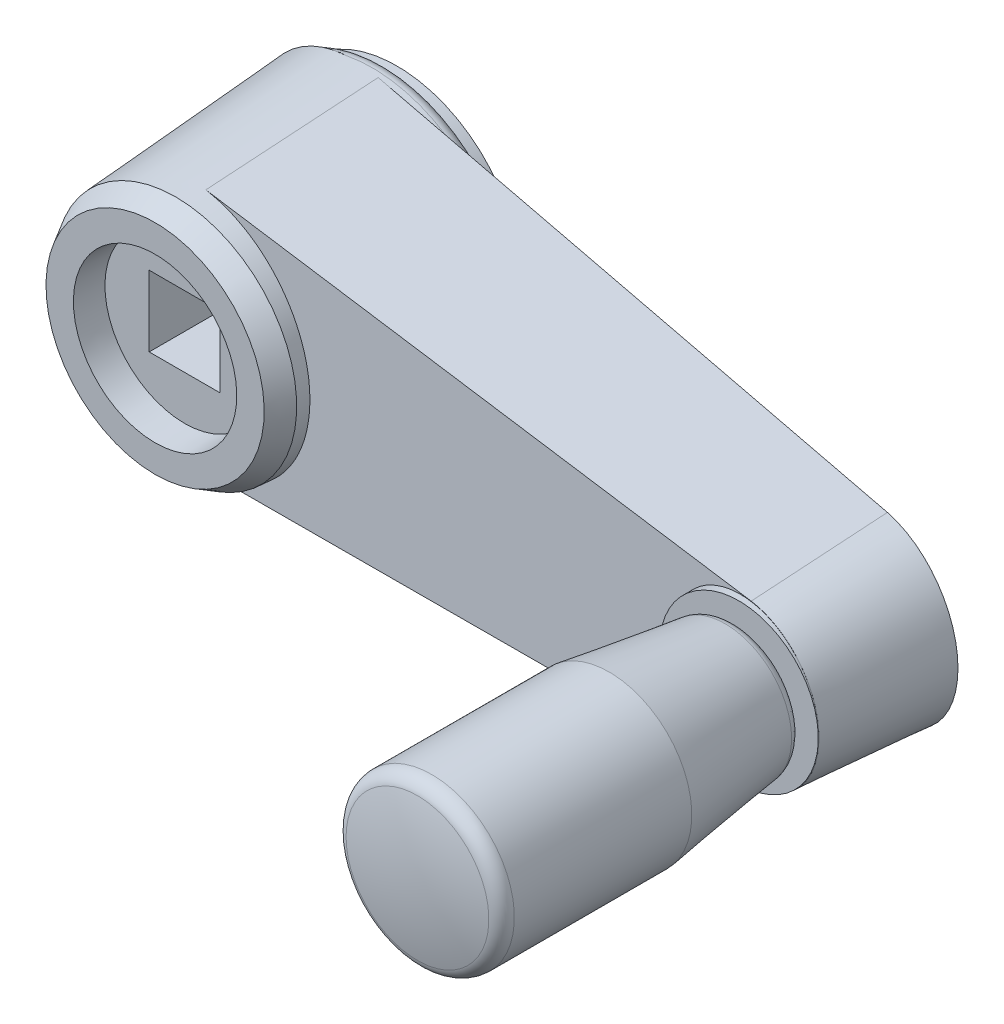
ISO-10303-21;
HEADER;
FILE_DESCRIPTION(('STEP AP214'),'2;1');
FILE_NAME('part.step','',(''),(''),'','','');
FILE_SCHEMA(('AUTOMOTIVE_DESIGN { 1 0 10303 214 1 1 1 1 }'));
ENDSEC;
DATA;
#1=APPLICATION_CONTEXT('core data for automotive mechanical design processes');
#2=APPLICATION_PROTOCOL_DEFINITION('international standard','automotive_design',2000,#1);
#3=PRODUCT_CONTEXT('',#1,'mechanical');
#4=PRODUCT('Part','Part','',(#3));
#5=PRODUCT_RELATED_PRODUCT_CATEGORY('part','',(#4));
#6=PRODUCT_DEFINITION_FORMATION('','',#4);
#7=PRODUCT_DEFINITION_CONTEXT('part definition',#1,'design');
#8=PRODUCT_DEFINITION('design','',#6,#7);
#9=PRODUCT_DEFINITION_SHAPE('','',#8);
#10=(LENGTH_UNIT() NAMED_UNIT(*) SI_UNIT(.MILLI.,.METRE.));
#11=(NAMED_UNIT(*) PLANE_ANGLE_UNIT() SI_UNIT($,.RADIAN.));
#12=(NAMED_UNIT(*) SI_UNIT($,.STERADIAN.) SOLID_ANGLE_UNIT());
#13=UNCERTAINTY_MEASURE_WITH_UNIT(LENGTH_MEASURE(1.E-05),#10,'distance_accuracy_value','');
#14=(GEOMETRIC_REPRESENTATION_CONTEXT(3) GLOBAL_UNCERTAINTY_ASSIGNED_CONTEXT((#13)) GLOBAL_UNIT_ASSIGNED_CONTEXT((#10,
#11,#12)) REPRESENTATION_CONTEXT('',''));
#15=CARTESIAN_POINT('',(0.,0.,0.));
#16=DIRECTION('',(0.,0.,1.));
#17=DIRECTION('',(1.,0.,0.));
#18=AXIS2_PLACEMENT_3D('',#15,#16,#17);
#19=CARTESIAN_POINT('',(-9.25,0.,20.5));
#20=DIRECTION('',(0.,0.,-1.));
#21=DIRECTION('',(0.,1.,0.));
#22=AXIS2_PLACEMENT_3D('',#19,#20,#21);
#23=PLANE('',#22);
#24=CARTESIAN_POINT('',(0.,0.,20.5));
#25=DIRECTION('',(0.,0.,1.));
#26=DIRECTION('',(0.,-1.,0.));
#27=AXIS2_PLACEMENT_3D('',#24,#25,#26);
#28=CIRCLE('',#27,9.25);
#29=CARTESIAN_POINT('',(0.,-9.25,20.5));
#30=VERTEX_POINT('',#29);
#31=EDGE_CURVE('E153',#30,#30,#28,.T.);
#32=ORIENTED_EDGE('',*,*,#31,.T.);
#33=EDGE_LOOP('',(#32));
#34=FACE_BOUND('',#33,.T.);
#35=CARTESIAN_POINT('',(0.,0.,20.5));
#36=DIRECTION('',(0.,0.,1.));
#37=DIRECTION('',(0.,-1.,0.));
#38=AXIS2_PLACEMENT_3D('',#35,#36,#37);
#39=CIRCLE('',#38,6.9248170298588);
#40=CARTESIAN_POINT('',(0.,-6.9248170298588,20.5));
#41=VERTEX_POINT('',#40);
#42=EDGE_CURVE('E139',#41,#41,#39,.T.);
#43=ORIENTED_EDGE('',*,*,#42,.F.);
#44=EDGE_LOOP('',(#43));
#45=FACE_BOUND('',#44,.T.);
#46=ADVANCED_FACE('F14',(#34,#45),#23,.F.);
#47=CARTESIAN_POINT('',(-11.5,-11.5,0.868643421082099));
#48=DIRECTION('',(-0.130237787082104,0.,0.99148278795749));
#49=DIRECTION('',(-0.99148278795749,0.,-0.130237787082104));
#50=AXIS2_PLACEMENT_3D('',#47,#48,#49);
#51=PLANE('',#50);
#52=CARTESIAN_POINT('',(-0.104670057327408,0.,2.36549497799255));
#53=DIRECTION('',(-0.130237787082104,0.,0.99148278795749));
#54=DIRECTION('',(-0.99148278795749,0.,-0.130237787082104));
#55=AXIS2_PLACEMENT_3D('',#52,#53,#54);
#56=ELLIPSE('',#55,11.4932201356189,11.394849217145);
#57=CARTESIAN_POINT('',(0.911596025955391,11.3494439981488,2.4989882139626));
#58=VERTEX_POINT('',#57);
#59=CARTESIAN_POINT('',(0.911596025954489,-11.3494439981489,2.4989882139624));
#60=VERTEX_POINT('',#59);
#61=EDGE_CURVE('E159',#58,#60,#56,.F.);
#62=ORIENTED_EDGE('',*,*,#61,.F.);
#63=DIRECTION('',(-0.988624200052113,0.0758813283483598,-0.129862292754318));
#64=VECTOR('',#63,1.);
#65=CARTESIAN_POINT('',(-9.71441205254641,12.1650376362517,1.10319214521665));
#66=LINE('',#65,#64);
#67=CARTESIAN_POINT('',(50.608289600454,7.53500052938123,9.02697586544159));
#68=VERTEX_POINT('',#67);
#69=EDGE_CURVE('E498',#68,#58,#66,.T.);
#70=ORIENTED_EDGE('',*,*,#69,.F.);
#71=CARTESIAN_POINT('',(49.930506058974,0.,8.9379445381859));
#72=DIRECTION('',(-0.130237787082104,0.,0.99148278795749));
#73=DIRECTION('',(-0.99148278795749,0.,-0.130237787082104));
#74=AXIS2_PLACEMENT_3D('',#71,#72,#73);
#75=ELLIPSE('',#74,7.63073206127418,7.56542032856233);
#76=CARTESIAN_POINT('',(50.608289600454,-7.53500052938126,9.02697586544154));
#77=VERTEX_POINT('',#76);
#78=EDGE_CURVE('E526',#68,#77,#75,.F.);
#79=ORIENTED_EDGE('',*,*,#78,.T.);
#80=DIRECTION('',(0.988624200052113,0.0758813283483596,0.129862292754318));
#81=VECTOR('',#80,1.);
#82=CARTESIAN_POINT('',(-11.4398287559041,-12.2974710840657,0.876547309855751));
#83=LINE('',#82,#81);
#84=EDGE_CURVE('E524',#77,#60,#83,.F.);
#85=ORIENTED_EDGE('',*,*,#84,.T.);
#86=EDGE_LOOP('',(#62,#70,#79,#85));
#87=FACE_BOUND('',#86,.T.);
#88=ADVANCED_FACE('F237',(#87),#51,.F.);
#89=CARTESIAN_POINT('',(56.7298365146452,-11.5,20.946098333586));
#90=DIRECTION('',(0.0697564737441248,0.,-0.997564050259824));
#91=DIRECTION('',(0.997564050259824,0.,0.0697564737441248));
#92=AXIS2_PLACEMENT_3D('',#89,#90,#91);
#93=PLANE('',#92);
#94=CARTESIAN_POINT('',(-0.0507248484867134,0.,16.9756146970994));
#95=DIRECTION('',(0.0697564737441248,0.,-0.997564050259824));
#96=DIRECTION('',(-0.997564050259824,0.,-0.0697564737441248));
#97=AXIS2_PLACEMENT_3D('',#94,#95,#96);
#98=ELLIPSE('',#97,10.3990223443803,10.3735668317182);
#99=CARTESIAN_POINT('',(0.836486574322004,-10.3355582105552,17.0376545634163));
#100=VERTEX_POINT('',#99);
#101=CARTESIAN_POINT('',(0.836486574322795,10.3355582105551,17.0376545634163));
#102=VERTEX_POINT('',#101);
#103=EDGE_CURVE('E500',#100,#102,#98,.F.);
#104=ORIENTED_EDGE('',*,*,#103,.F.);
#105=DIRECTION('',(-0.994968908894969,-0.072084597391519,-0.0695750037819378));
#106=VECTOR('',#105,1.);
#107=CARTESIAN_POINT('',(56.355888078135,-6.31322779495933,20.9199493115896));
#108=LINE('',#107,#106);
#109=CARTESIAN_POINT('',(50.5487553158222,-6.7339493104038,20.5138750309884));
#110=VERTEX_POINT('',#109);
#111=EDGE_CURVE('E531',#100,#110,#108,.F.);
#112=ORIENTED_EDGE('',*,*,#111,.T.);
#113=CARTESIAN_POINT('',(49.9669495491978,0.,20.473191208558));
#114=DIRECTION('',(0.0697564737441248,0.,-0.997564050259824));
#115=DIRECTION('',(-0.997564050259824,0.,-0.0697564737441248));
#116=AXIS2_PLACEMENT_3D('',#113,#114,#115);
#117=ELLIPSE('',#116,6.77562154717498,6.7590356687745);
#118=CARTESIAN_POINT('',(56.7191173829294,-0.306403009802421,20.9453487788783));
#119=VERTEX_POINT('',#118);
#120=EDGE_CURVE('E532',#110,#119,#117,.F.);
#121=ORIENTED_EDGE('',*,*,#120,.T.);
#122=CARTESIAN_POINT('',(50.,0.,20.4755023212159));
#123=DIRECTION('',(0.0697564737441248,0.,-0.997564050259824));
#124=DIRECTION('',(0.997564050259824,0.,0.0697564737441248));
#125=AXIS2_PLACEMENT_3D('',#122,#123,#124);
#126=ELLIPSE('',#125,6.74252445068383,6.7261);
#127=CARTESIAN_POINT('',(56.719117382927,0.306403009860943,20.9453487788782));
#128=VERTEX_POINT('',#127);
#129=EDGE_CURVE('E504',#119,#128,#126,.T.);
#130=ORIENTED_EDGE('',*,*,#129,.T.);
#131=CARTESIAN_POINT('',(50.5487553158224,6.73394931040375,20.5138750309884));
#132=VERTEX_POINT('',#131);
#133=EDGE_CURVE('E534',#128,#132,#117,.F.);
#134=ORIENTED_EDGE('',*,*,#133,.T.);
#135=DIRECTION('',(0.994968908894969,-0.0720845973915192,0.0695750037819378));
#136=VECTOR('',#135,1.);
#137=CARTESIAN_POINT('',(58.0054925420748,6.19371544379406,21.0353008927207));
#138=LINE('',#137,#136);
#139=EDGE_CURVE('E198',#102,#132,#138,.T.);
#140=ORIENTED_EDGE('',*,*,#139,.F.);
#141=EDGE_LOOP('',(#104,#112,#121,#130,#134,#140));
#142=FACE_BOUND('',#141,.T.);
#143=ADVANCED_FACE('F234',(#142),#93,.F.);
#144=CARTESIAN_POINT('',(0.,0.,0.868643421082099));
#145=DIRECTION('',(0.,0.,-1.));
#146=DIRECTION('',(0.,-1.,0.));
#147=AXIS2_PLACEMENT_3D('',#144,#145,#146);
#148=CONICAL_SURFACE('',#147,11.5,0.0698131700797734);
#149=CARTESIAN_POINT('',(-0.104670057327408,0.,2.36549497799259));
#150=DIRECTION('',(-0.130237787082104,0.,0.99148278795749));
#151=DIRECTION('',(-0.99148278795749,0.,-0.130237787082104));
#152=AXIS2_PLACEMENT_3D('',#149,#150,#151);
#153=ELLIPSE('',#152,11.4932201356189,11.3948492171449);
#154=CARTESIAN_POINT('',(-2.2077738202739,-11.1991033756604,2.0892384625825));
#155=VERTEX_POINT('',#154);
#156=CARTESIAN_POINT('',(-2.2077738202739,11.1991033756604,2.0892384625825));
#157=VERTEX_POINT('',#156);
#158=EDGE_CURVE('E509',#155,#157,#153,.F.);
#159=ORIENTED_EDGE('',*,*,#158,.F.);
#160=CARTESIAN_POINT('',(0.,0.,2.0892384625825));
#161=DIRECTION('',(0.,0.,1.));
#162=DIRECTION('',(0.,-1.,0.));
#163=AXIS2_PLACEMENT_3D('',#160,#161,#162);
#164=CIRCLE('',#163,11.4146476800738);
#165=EDGE_CURVE('E147',#155,#157,#164,.T.);
#166=ORIENTED_EDGE('',*,*,#165,.T.);
#167=EDGE_LOOP('',(#159,#166));
#168=FACE_BOUND('',#167,.T.);
#169=CARTESIAN_POINT('',(0.816240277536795,10.0629979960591,20.946098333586));
#170=CARTESIAN_POINT('',(0.833583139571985,10.2963518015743,17.59985587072));
#171=CARTESIAN_POINT('',(0.850901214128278,10.5297072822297,14.2536133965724));
#172=CARTESIAN_POINT('',(0.885487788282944,10.9964215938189,7.56112842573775));
#173=CARTESIAN_POINT('',(0.902756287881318,11.2297804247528,4.21488592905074));
#174=CARTESIAN_POINT('',(0.920000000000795,11.4631409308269,0.868643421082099));
#175=B_SPLINE_CURVE_WITH_KNOTS('',3,(#169,#170,#171,#172,#173,#174),.UNSPECIFIED.,.F.,.F.,(4,2,
4),(0.,10.0632420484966,20.1264840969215),.UNSPECIFIED.);
#176=EDGE_CURVE('E188',#102,#58,#175,.T.);
#177=ORIENTED_EDGE('',*,*,#176,.T.);
#178=ORIENTED_EDGE('',*,*,#61,.T.);
#179=CARTESIAN_POINT('',(0.816240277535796,-10.0629979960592,20.946098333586));
#180=CARTESIAN_POINT('',(0.833583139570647,-10.2963518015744,17.59985587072));
#181=CARTESIAN_POINT('',(0.850901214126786,-10.5297072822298,14.2536133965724));
#182=CARTESIAN_POINT('',(0.885487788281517,-10.9964215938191,7.56112842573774));
#183=CARTESIAN_POINT('',(0.902756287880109,-11.229780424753,4.21488592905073));
#184=CARTESIAN_POINT('',(0.91999999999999,-11.463140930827,0.868643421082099));
#185=B_SPLINE_CURVE_WITH_KNOTS('',3,(#179,#180,#181,#182,#183,#184),.UNSPECIFIED.,.F.,.F.,(4,2,
4),(0.,10.0632420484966,20.1264840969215),.UNSPECIFIED.);
#186=EDGE_CURVE('E189',#100,#60,#185,.T.);
#187=ORIENTED_EDGE('',*,*,#186,.F.);
#188=ORIENTED_EDGE('',*,*,#103,.T.);
#189=EDGE_LOOP('',(#177,#178,#187,#188));
#190=FACE_BOUND('',#189,.T.);
#191=CARTESIAN_POINT('',(0.,0.,18.744476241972));
#192=DIRECTION('',(0.,0.,1.));
#193=DIRECTION('',(0.,-1.,0.));
#194=AXIS2_PLACEMENT_3D('',#191,#192,#193);
#195=CIRCLE('',#194,10.25);
#196=CARTESIAN_POINT('',(0.,-10.25,18.744476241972));
#197=VERTEX_POINT('',#196);
#198=EDGE_CURVE('E150',#197,#197,#195,.T.);
#199=ORIENTED_EDGE('',*,*,#198,.F.);
#200=EDGE_LOOP('',(#199));
#201=FACE_BOUND('',#200,.T.);
#202=ADVANCED_FACE('F206',(#168,#190,#201),#148,.T.);
#203=CARTESIAN_POINT('',(0.91999999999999,-11.4631409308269,0.868643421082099));
#204=DIRECTION('',(0.0672304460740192,-0.995295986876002,0.0697564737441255));
#205=DIRECTION('',(0.,-0.0699146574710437,-0.997552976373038));
#206=AXIS2_PLACEMENT_3D('',#203,#204,#205);
#207=PLANE('',#206);
#208=ORIENTED_EDGE('',*,*,#111,.F.);
#209=ORIENTED_EDGE('',*,*,#186,.T.);
#210=ORIENTED_EDGE('',*,*,#84,.F.);
#211=CARTESIAN_POINT('',(50.5465090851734,-6.70380816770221,20.946098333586));
#212=CARTESIAN_POINT('',(50.5682362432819,-6.99540068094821,16.7646715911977));
#213=CARTESIAN_POINT('',(50.5899069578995,-7.28699700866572,12.5832448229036));
#214=CARTESIAN_POINT('',(50.6245011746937,-7.75371080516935,5.89075983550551));
#215=CARTESIAN_POINT('',(50.6374607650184,-7.9288258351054,3.37970163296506));
#216=CARTESIAN_POINT('',(50.6504,-8.10394224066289,0.868643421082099));
#217=B_SPLINE_CURVE_WITH_KNOTS('',3,(#211,#212,#213,#214,#215,#216),.UNSPECIFIED.,.F.,.F.,(4,2,
4),(0.,12.5749135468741,20.1264841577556),.UNSPECIFIED.);
#218=EDGE_CURVE('E199',#110,#77,#217,.T.);
#219=ORIENTED_EDGE('',*,*,#218,.F.);
#220=EDGE_LOOP('',(#208,#209,#210,#219));
#221=FACE_BOUND('',#220,.T.);
#222=ADVANCED_FACE('F209',(#221),#207,.T.);
#223=CARTESIAN_POINT('',(50.,0.,0.868643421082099));
#224=DIRECTION('',(0.,0.,-1.));
#225=DIRECTION('',(0.,-1.,0.));
#226=AXIS2_PLACEMENT_3D('',#223,#224,#225);
#227=CONICAL_SURFACE('',#226,8.13,0.0698131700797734);
#228=ORIENTED_EDGE('',*,*,#133,.F.);
#229=CARTESIAN_POINT('',(50.,0.,20.9453487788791));
#230=DIRECTION('',(0.,0.,-1.));
#231=DIRECTION('',(0.,1.,0.));
#232=AXIS2_PLACEMENT_3D('',#229,#230,#231);
#233=CIRCLE('',#232,6.7261);
#234=EDGE_CURVE('E185',#128,#119,#233,.T.);
#235=ORIENTED_EDGE('',*,*,#234,.T.);
#236=ORIENTED_EDGE('',*,*,#120,.F.);
#237=ORIENTED_EDGE('',*,*,#218,.T.);
#238=ORIENTED_EDGE('',*,*,#78,.F.);
#239=CARTESIAN_POINT('',(50.5465090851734,6.70380816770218,20.946098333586));
#240=CARTESIAN_POINT('',(50.5682362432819,6.99540068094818,16.7646715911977));
#241=CARTESIAN_POINT('',(50.5899069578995,7.28699700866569,12.5832448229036));
#242=CARTESIAN_POINT('',(50.6245011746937,7.75371080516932,5.89075983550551));
#243=CARTESIAN_POINT('',(50.6374607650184,7.92882583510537,3.37970163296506));
#244=CARTESIAN_POINT('',(50.6504,8.10394224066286,0.868643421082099));
#245=B_SPLINE_CURVE_WITH_KNOTS('',3,(#239,#240,#241,#242,#243,#244),.UNSPECIFIED.,.F.,.F.,(4,2,
4),(0.,12.5749135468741,20.1264841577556),.UNSPECIFIED.);
#246=EDGE_CURVE('E225',#132,#68,#245,.T.);
#247=ORIENTED_EDGE('',*,*,#246,.F.);
#248=EDGE_LOOP('',(#228,#235,#236,#237,#238,#247));
#249=FACE_BOUND('',#248,.T.);
#250=ADVANCED_FACE('F212',(#249),#227,.T.);
#251=CARTESIAN_POINT('',(0.91999999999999,11.4631409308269,0.868643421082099));
#252=DIRECTION('',(0.0672304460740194,0.995295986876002,0.0697564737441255));
#253=DIRECTION('',(0.,-0.0699146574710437,0.997552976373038));
#254=AXIS2_PLACEMENT_3D('',#251,#252,#253);
#255=PLANE('',#254);
#256=ORIENTED_EDGE('',*,*,#176,.F.);
#257=ORIENTED_EDGE('',*,*,#139,.T.);
#258=ORIENTED_EDGE('',*,*,#246,.T.);
#259=ORIENTED_EDGE('',*,*,#69,.T.);
#260=EDGE_LOOP('',(#256,#257,#258,#259));
#261=FACE_BOUND('',#260,.T.);
#262=ADVANCED_FACE('F214',(#261),#255,.T.);
#263=CARTESIAN_POINT('',(0.,0.,2.37924407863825));
#264=DIRECTION('',(-0.130237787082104,0.,0.99148278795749));
#265=DIRECTION('',(0.99148278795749,0.,0.130237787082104));
#266=AXIS2_PLACEMENT_3D('',#263,#264,#265);
#267=ELLIPSE('',#266,10.5901989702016,10.5);
#268=CARTESIAN_POINT('',(-10.3254713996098,-1.90647328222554,1.0229254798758));
#269=VERTEX_POINT('',#268);
#270=CARTESIAN_POINT('',(-10.3254713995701,1.90647328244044,1.0229254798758));
#271=VERTEX_POINT('',#270);
#272=EDGE_CURVE('E28',#269,#271,#267,.F.);
#273=ORIENTED_EDGE('',*,*,#272,.F.);
#274=CARTESIAN_POINT('',(-10.2868458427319,0.,1.02799920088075));
#275=CARTESIAN_POINT('',(-10.288922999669,-0.0186180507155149,1.02772635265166));
#276=CARTESIAN_POINT('',(-10.2909504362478,-0.0372425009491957,1.02746003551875));
#277=CARTESIAN_POINT('',(-10.3282925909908,-0.389018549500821,1.0225548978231));
#278=CARTESIAN_POINT('',(-10.3477502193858,-0.724105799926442,1.01999901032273));
#279=CARTESIAN_POINT('',(-10.3545534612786,-1.39492341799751,1.01910535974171));
#280=CARTESIAN_POINT('',(-10.341851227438,-1.73065400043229,1.02077388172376));
#281=CARTESIAN_POINT('',(-10.2630896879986,-2.64423253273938,1.03111972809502));
#282=CARTESIAN_POINT('',(-10.1648024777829,-3.21958493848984,1.04403039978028));
#283=CARTESIAN_POINT('',(-9.87339886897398,-4.34599471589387,1.08230818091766));
#284=CARTESIAN_POINT('',(-9.68019036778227,-4.89702792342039,1.10768738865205));
#285=CARTESIAN_POINT('',(-9.32372276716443,-5.69192330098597,1.15451175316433));
#286=CARTESIAN_POINT('',(-9.19387776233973,-5.95148315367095,1.1715677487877));
#287=CARTESIAN_POINT('',(-8.91281276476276,-6.45851450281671,1.208487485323));
#288=CARTESIAN_POINT('',(-8.76160056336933,-6.70599036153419,1.22835020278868));
#289=CARTESIAN_POINT('',(-8.43881444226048,-7.18704333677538,1.27075028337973));
#290=CARTESIAN_POINT('',(-8.26723934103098,-7.42061964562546,1.29328780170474));
#291=CARTESIAN_POINT('',(-7.90498341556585,-7.87204819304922,1.34087250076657));
#292=CARTESIAN_POINT('',(-7.71430968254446,-8.08990621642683,1.36591875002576));
#293=CARTESIAN_POINT('',(-7.31726644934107,-8.50610364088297,1.41807299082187));
#294=CARTESIAN_POINT('',(-7.11108540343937,-8.70462595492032,1.44515622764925));
#295=CARTESIAN_POINT('',(-6.68270931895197,-9.08324402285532,1.50142624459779));
#296=CARTESIAN_POINT('',(-6.46051433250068,-9.263339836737,1.53061301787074));
#297=CARTESIAN_POINT('',(-6.00167551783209,-9.60370566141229,1.59088451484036));
#298=CARTESIAN_POINT('',(-5.76503215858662,-9.76397631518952,1.62196917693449));
#299=CARTESIAN_POINT('',(-5.27897465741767,-10.0634190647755,1.68581602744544));
#300=CARTESIAN_POINT('',(-5.02956099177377,-10.2025919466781,1.71857815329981));
#301=CARTESIAN_POINT('',(-4.52357238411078,-10.4567723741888,1.78504308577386));
#302=CARTESIAN_POINT('',(-4.26716095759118,-10.5721110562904,1.81872441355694));
#303=CARTESIAN_POINT('',(-3.74549893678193,-10.7802282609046,1.88724815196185));
#304=CARTESIAN_POINT('',(-3.48024875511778,-10.8730078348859,1.92209050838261));
#305=CARTESIAN_POINT('',(-2.94240262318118,-11.0352705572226,1.99274013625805));
#306=CARTESIAN_POINT('',(-2.66979649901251,-11.104719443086,2.02854874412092));
#307=CARTESIAN_POINT('',(-2.11956820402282,-11.2194337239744,2.10082485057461));
#308=CARTESIAN_POINT('',(-1.84194493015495,-11.2646937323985,2.13729249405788));
#309=CARTESIAN_POINT('',(-1.56285300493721,-11.2974936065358,2.1739530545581));
#310=B_SPLINE_CURVE_WITH_KNOTS('',3,(#274,#275,#276,#277,#278,#279,#280,#281,#282,#283,#284,
#285,#286,#287,#288,#289,#290,#291,#292,#293,#294,#295,#296,#297,#298,#299,#300,#301,#302,#303,
#304,#305,#306,#307,#308,#309),.UNSPECIFIED.,.F.,.F.,(4,2,2,2,2,2,2,2,2,2,2,2,2,2,2,2,2,4),(0.,
0.0562087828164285,1.06131769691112,2.06792288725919,3.81068822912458,5.55514793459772,
6.42645227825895,7.2974397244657,8.16847773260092,9.03919351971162,9.90065083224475,
10.7621053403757,11.6235319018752,12.4849263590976,13.3334011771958,14.1818364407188,
15.0315122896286,15.8813772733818),.UNSPECIFIED.);
#311=EDGE_CURVE('E9',#269,#155,#310,.T.);
#312=ORIENTED_EDGE('',*,*,#311,.T.);
#313=ORIENTED_EDGE('',*,*,#158,.T.);
#314=CARTESIAN_POINT('',(-10.2868458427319,0.,1.02799920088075));
#315=CARTESIAN_POINT('',(-10.288922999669,0.0186180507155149,1.02772635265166));
#316=CARTESIAN_POINT('',(-10.2909504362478,0.0372425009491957,1.02746003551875));
#317=CARTESIAN_POINT('',(-10.3282925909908,0.389018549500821,1.0225548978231));
#318=CARTESIAN_POINT('',(-10.3477502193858,0.724105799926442,1.01999901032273));
#319=CARTESIAN_POINT('',(-10.3545534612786,1.39492341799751,1.01910535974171));
#320=CARTESIAN_POINT('',(-10.341851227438,1.73065400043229,1.02077388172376));
#321=CARTESIAN_POINT('',(-10.2630896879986,2.64423253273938,1.03111972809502));
#322=CARTESIAN_POINT('',(-10.1648024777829,3.21958493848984,1.04403039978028));
#323=CARTESIAN_POINT('',(-9.87339886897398,4.34599471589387,1.08230818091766));
#324=CARTESIAN_POINT('',(-9.68019036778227,4.89702792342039,1.10768738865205));
#325=CARTESIAN_POINT('',(-9.32372276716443,5.69192330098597,1.15451175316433));
#326=CARTESIAN_POINT('',(-9.19387776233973,5.95148315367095,1.1715677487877));
#327=CARTESIAN_POINT('',(-8.91281276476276,6.45851450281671,1.208487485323));
#328=CARTESIAN_POINT('',(-8.76160056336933,6.70599036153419,1.22835020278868));
#329=CARTESIAN_POINT('',(-8.43881444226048,7.18704333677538,1.27075028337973));
#330=CARTESIAN_POINT('',(-8.26723934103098,7.42061964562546,1.29328780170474));
#331=CARTESIAN_POINT('',(-7.90498341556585,7.87204819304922,1.34087250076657));
#332=CARTESIAN_POINT('',(-7.71430968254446,8.08990621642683,1.36591875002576));
#333=CARTESIAN_POINT('',(-7.31726644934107,8.50610364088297,1.41807299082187));
#334=CARTESIAN_POINT('',(-7.11108540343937,8.70462595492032,1.44515622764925));
#335=CARTESIAN_POINT('',(-6.68270931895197,9.08324402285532,1.50142624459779));
#336=CARTESIAN_POINT('',(-6.46051433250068,9.263339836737,1.53061301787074));
#337=CARTESIAN_POINT('',(-6.00167551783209,9.60370566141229,1.59088451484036));
#338=CARTESIAN_POINT('',(-5.76503215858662,9.76397631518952,1.62196917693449));
#339=CARTESIAN_POINT('',(-5.27897465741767,10.0634190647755,1.68581602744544));
#340=CARTESIAN_POINT('',(-5.02956099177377,10.2025919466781,1.71857815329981));
#341=CARTESIAN_POINT('',(-4.52357238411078,10.4567723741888,1.78504308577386));
#342=CARTESIAN_POINT('',(-4.26716095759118,10.5721110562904,1.81872441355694));
#343=CARTESIAN_POINT('',(-3.74549893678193,10.7802282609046,1.88724815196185));
#344=CARTESIAN_POINT('',(-3.48024875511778,10.8730078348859,1.92209050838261));
#345=CARTESIAN_POINT('',(-2.94240262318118,11.0352705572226,1.99274013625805));
#346=CARTESIAN_POINT('',(-2.66979649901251,11.104719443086,2.02854874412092));
#347=CARTESIAN_POINT('',(-2.11956820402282,11.2194337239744,2.10082485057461));
#348=CARTESIAN_POINT('',(-1.84194493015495,11.2646937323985,2.13729249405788));
#349=CARTESIAN_POINT('',(-1.56285300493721,11.2974936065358,2.1739530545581));
#350=B_SPLINE_CURVE_WITH_KNOTS('',3,(#314,#315,#316,#317,#318,#319,#320,#321,#322,#323,#324,
#325,#326,#327,#328,#329,#330,#331,#332,#333,#334,#335,#336,#337,#338,#339,#340,#341,#342,#343,
#344,#345,#346,#347,#348,#349),.UNSPECIFIED.,.F.,.F.,(4,2,2,2,2,2,2,2,2,2,2,2,2,2,2,2,2,4),(0.,
0.0562087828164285,1.06131769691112,2.06792288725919,3.81068822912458,5.55514793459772,
6.42645227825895,7.2974397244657,8.16847773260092,9.03919351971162,9.90065083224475,
10.7621053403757,11.6235319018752,12.4849263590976,13.3334011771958,14.1818364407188,
15.0315122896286,15.8813772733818),.UNSPECIFIED.);
#351=EDGE_CURVE('E503',#157,#271,#350,.F.);
#352=ORIENTED_EDGE('',*,*,#351,.T.);
#353=EDGE_LOOP('',(#273,#312,#313,#352));
#354=FACE_BOUND('',#353,.T.);
#355=ADVANCED_FACE('F16',(#354),#51,.F.);
#356=CARTESIAN_POINT('',(50.,0.,49.));
#357=DIRECTION('',(0.,0.,1.));
#358=DIRECTION('',(-1.,0.,0.));
#359=AXIS2_PLACEMENT_3D('',#356,#357,#358);
#360=CYLINDRICAL_SURFACE('',#359,6.7261);
#361=CARTESIAN_POINT('',(50.,0.,21.));
#362=DIRECTION('',(0.,0.,1.));
#363=DIRECTION('',(-1.,0.,0.));
#364=AXIS2_PLACEMENT_3D('',#361,#362,#363);
#365=CIRCLE('',#364,6.7261);
#366=CARTESIAN_POINT('',(43.2739,0.,21.));
#367=VERTEX_POINT('',#366);
#368=EDGE_CURVE('E161',#367,#367,#365,.T.);
#369=ORIENTED_EDGE('',*,*,#368,.F.);
#370=EDGE_LOOP('',(#369));
#371=FACE_BOUND('',#370,.T.);
#372=ORIENTED_EDGE('',*,*,#234,.F.);
#373=ORIENTED_EDGE('',*,*,#129,.F.);
#374=EDGE_LOOP('',(#372,#373));
#375=FACE_BOUND('',#374,.T.);
#376=ADVANCED_FACE('F265',(#371,#375),#360,.T.);
#377=CARTESIAN_POINT('',(50.,0.,24.));
#378=DIRECTION('',(0.,-1.,0.));
#379=DIRECTION('',(1.,0.,0.));
#380=AXIS2_PLACEMENT_3D('',#377,#378,#379);
#381=SPHERICAL_SURFACE('',#380,25.);
#382=CARTESIAN_POINT('',(50.,0.,24.));
#383=DIRECTION('',(0.,0.,1.));
#384=DIRECTION('',(-1.,0.,0.));
#385=AXIS2_PLACEMENT_3D('',#382,#383,#384);
#386=SPHERICAL_SURFACE('',#385,25.);
#387=CARTESIAN_POINT('',(50.,0.,48.2562497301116));
#388=DIRECTION('',(0.,0.,1.));
#389=DIRECTION('',(-1.,0.,0.));
#390=AXIS2_PLACEMENT_3D('',#387,#388,#389);
#391=CIRCLE('',#390,6.05263157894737);
#392=CARTESIAN_POINT('',(43.9473684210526,0.,48.2562497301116));
#393=VERTEX_POINT('',#392);
#394=EDGE_CURVE('E182',#393,#393,#391,.T.);
#395=ORIENTED_EDGE('',*,*,#394,.T.);
#396=EDGE_LOOP('',(#395));
#397=FACE_BOUND('',#396,.T.);
#398=ADVANCED_FACE('F268',(#397),#386,.T.);
#399=CARTESIAN_POINT('',(50.,0.,47.043437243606));
#400=DIRECTION('',(0.,0.,1.));
#401=DIRECTION('',(-1.,0.,0.));
#402=AXIS2_PLACEMENT_3D('',#399,#400,#401);
#403=TOROIDAL_SURFACE('',#402,5.75,1.25);
#404=CARTESIAN_POINT('',(50.,0.,47.043437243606));
#405=DIRECTION('',(0.,0.,1.));
#406=DIRECTION('',(-1.,0.,0.));
#407=AXIS2_PLACEMENT_3D('',#404,#405,#406);
#408=CIRCLE('',#407,7.);
#409=CARTESIAN_POINT('',(43.,0.,47.043437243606));
#410=VERTEX_POINT('',#409);
#411=EDGE_CURVE('E179',#410,#410,#408,.T.);
#412=ORIENTED_EDGE('',*,*,#411,.T.);
#413=EDGE_LOOP('',(#412));
#414=FACE_BOUND('',#413,.T.);
#415=ORIENTED_EDGE('',*,*,#394,.F.);
#416=EDGE_LOOP('',(#415));
#417=FACE_BOUND('',#416,.T.);
#418=ADVANCED_FACE('F293',(#414,#417),#403,.T.);
#419=CARTESIAN_POINT('',(50.,0.,49.));
#420=DIRECTION('',(0.,0.,1.));
#421=DIRECTION('',(-1.,0.,0.));
#422=AXIS2_PLACEMENT_3D('',#419,#420,#421);
#423=CYLINDRICAL_SURFACE('',#422,7.);
#424=ORIENTED_EDGE('',*,*,#411,.F.);
#425=EDGE_LOOP('',(#424));
#426=FACE_BOUND('',#425,.T.);
#427=CARTESIAN_POINT('',(50.,0.,32.));
#428=DIRECTION('',(0.,0.,1.));
#429=DIRECTION('',(-1.,0.,0.));
#430=AXIS2_PLACEMENT_3D('',#427,#428,#429);
#431=CIRCLE('',#430,7.00000000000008);
#432=CARTESIAN_POINT('',(42.9999999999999,0.,32.));
#433=VERTEX_POINT('',#432);
#434=EDGE_CURVE('E176',#433,#433,#431,.T.);
#435=ORIENTED_EDGE('',*,*,#434,.T.);
#436=EDGE_LOOP('',(#435));
#437=FACE_BOUND('',#436,.T.);
#438=ADVANCED_FACE('F289',(#426,#437),#423,.T.);
#439=CARTESIAN_POINT('',(50.,0.,32.));
#440=DIRECTION('',(0.,0.,1.));
#441=DIRECTION('',(-1.,0.,0.));
#442=AXIS2_PLACEMENT_3D('',#439,#440,#441);
#443=CONICAL_SURFACE('',#442,7.00000000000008,0.139279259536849);
#444=CARTESIAN_POINT('',(50.,0.,22.1611706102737));
#445=DIRECTION('',(0.,0.,1.));
#446=DIRECTION('',(-1.,0.,0.));
#447=AXIS2_PLACEMENT_3D('',#444,#445,#446);
#448=CIRCLE('',#447,5.62072485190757);
#449=CARTESIAN_POINT('',(44.3792751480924,0.,22.1611706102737));
#450=VERTEX_POINT('',#449);
#451=EDGE_CURVE('E173',#450,#450,#448,.T.);
#452=ORIENTED_EDGE('',*,*,#451,.T.);
#453=EDGE_LOOP('',(#452));
#454=FACE_BOUND('',#453,.T.);
#455=ORIENTED_EDGE('',*,*,#434,.F.);
#456=EDGE_LOOP('',(#455));
#457=FACE_BOUND('',#456,.T.);
#458=ADVANCED_FACE('F285',(#454,#457),#443,.T.);
#459=CARTESIAN_POINT('',(50.,0.,22.3));
#460=DIRECTION('',(0.,0.,1.));
#461=DIRECTION('',(-1.,0.,0.));
#462=AXIS2_PLACEMENT_3D('',#459,#460,#461);
#463=TOROIDAL_SURFACE('',#462,4.63040853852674,1.);
#464=CARTESIAN_POINT('',(50.,0.,21.3));
#465=DIRECTION('',(0.,0.,1.));
#466=DIRECTION('',(-1.,0.,0.));
#467=AXIS2_PLACEMENT_3D('',#464,#465,#466);
#468=CIRCLE('',#467,4.63040853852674);
#469=CARTESIAN_POINT('',(45.3695914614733,0.,21.3));
#470=VERTEX_POINT('',#469);
#471=EDGE_CURVE('E170',#470,#470,#468,.T.);
#472=ORIENTED_EDGE('',*,*,#471,.T.);
#473=EDGE_LOOP('',(#472));
#474=FACE_BOUND('',#473,.T.);
#475=ORIENTED_EDGE('',*,*,#451,.F.);
#476=EDGE_LOOP('',(#475));
#477=FACE_BOUND('',#476,.T.);
#478=ADVANCED_FACE('F281',(#474,#477),#463,.T.);
#479=CARTESIAN_POINT('',(46.0739,0.,21.3));
#480=DIRECTION('',(0.,0.,1.));
#481=DIRECTION('',(-1.,0.,0.));
#482=AXIS2_PLACEMENT_3D('',#479,#480,#481);
#483=PLANE('',#482);
#484=ORIENTED_EDGE('',*,*,#471,.F.);
#485=EDGE_LOOP('',(#484));
#486=FACE_BOUND('',#485,.T.);
#487=CARTESIAN_POINT('',(50.,0.,21.3));
#488=DIRECTION('',(0.,0.,1.));
#489=DIRECTION('',(-1.,0.,0.));
#490=AXIS2_PLACEMENT_3D('',#487,#488,#489);
#491=CIRCLE('',#490,3.9261);
#492=CARTESIAN_POINT('',(46.0739,0.,21.3));
#493=VERTEX_POINT('',#492);
#494=EDGE_CURVE('E167',#493,#493,#491,.T.);
#495=ORIENTED_EDGE('',*,*,#494,.T.);
#496=EDGE_LOOP('',(#495));
#497=FACE_BOUND('',#496,.T.);
#498=ADVANCED_FACE('F277',(#486,#497),#483,.F.);
#499=CARTESIAN_POINT('',(50.,0.,49.));
#500=DIRECTION('',(0.,0.,1.));
#501=DIRECTION('',(-1.,0.,0.));
#502=AXIS2_PLACEMENT_3D('',#499,#500,#501);
#503=CYLINDRICAL_SURFACE('',#502,3.9261);
#504=CARTESIAN_POINT('',(50.,0.,21.));
#505=DIRECTION('',(0.,0.,1.));
#506=DIRECTION('',(-1.,0.,0.));
#507=AXIS2_PLACEMENT_3D('',#504,#505,#506);
#508=CIRCLE('',#507,3.9261);
#509=CARTESIAN_POINT('',(46.0739,0.,21.));
#510=VERTEX_POINT('',#509);
#511=EDGE_CURVE('E164',#510,#510,#508,.T.);
#512=ORIENTED_EDGE('',*,*,#511,.T.);
#513=EDGE_LOOP('',(#512));
#514=FACE_BOUND('',#513,.T.);
#515=ORIENTED_EDGE('',*,*,#494,.F.);
#516=EDGE_LOOP('',(#515));
#517=FACE_BOUND('',#516,.T.);
#518=ADVANCED_FACE('F273',(#514,#517),#503,.T.);
#519=CARTESIAN_POINT('',(43.2739,0.,21.));
#520=DIRECTION('',(0.,0.,-1.));
#521=DIRECTION('',(1.,0.,0.));
#522=AXIS2_PLACEMENT_3D('',#519,#520,#521);
#523=PLANE('',#522);
#524=ORIENTED_EDGE('',*,*,#511,.F.);
#525=EDGE_LOOP('',(#524));
#526=FACE_BOUND('',#525,.T.);
#527=ORIENTED_EDGE('',*,*,#368,.T.);
#528=EDGE_LOOP('',(#527));
#529=FACE_BOUND('',#528,.T.);
#530=ADVANCED_FACE('F270',(#526,#529),#523,.F.);
#531=CARTESIAN_POINT('',(0.,0.,18.744476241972));
#532=DIRECTION('',(0.,0.,-1.));
#533=DIRECTION('',(0.,1.,0.));
#534=AXIS2_PLACEMENT_3D('',#531,#532,#533);
#535=CONICAL_SURFACE('',#534,10.25,0.51778964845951);
#536=ORIENTED_EDGE('',*,*,#31,.F.);
#537=EDGE_LOOP('',(#536));
#538=FACE_BOUND('',#537,.T.);
#539=ORIENTED_EDGE('',*,*,#198,.T.);
#540=EDGE_LOOP('',(#539));
#541=FACE_BOUND('',#540,.T.);
#542=ADVANCED_FACE('F255',(#538,#541),#535,.T.);
#543=CARTESIAN_POINT('',(0.,0.,25.3959377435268));
#544=DIRECTION('',(0.,0.,1.));
#545=DIRECTION('',(0.,-1.,0.));
#546=AXIS2_PLACEMENT_3D('',#543,#544,#545);
#547=CYLINDRICAL_SURFACE('',#546,10.5);
#548=CARTESIAN_POINT('',(0.,0.,0.));
#549=DIRECTION('',(0.,0.,1.));
#550=DIRECTION('',(0.,-1.,0.));
#551=AXIS2_PLACEMENT_3D('',#548,#549,#550);
#552=CIRCLE('',#551,10.5);
#553=CARTESIAN_POINT('',(0.,-10.5,0.));
#554=VERTEX_POINT('',#553);
#555=EDGE_CURVE('E156',#554,#554,#552,.T.);
#556=ORIENTED_EDGE('',*,*,#555,.T.);
#557=EDGE_LOOP('',(#556));
#558=FACE_BOUND('',#557,.T.);
#559=CARTESIAN_POINT('',(0.,0.,1.0229254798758));
#560=DIRECTION('',(0.,0.,1.));
#561=DIRECTION('',(0.,-1.,0.));
#562=AXIS2_PLACEMENT_3D('',#559,#560,#561);
#563=CIRCLE('',#562,10.5);
#564=EDGE_CURVE('E145',#269,#271,#563,.T.);
#565=ORIENTED_EDGE('',*,*,#564,.F.);
#566=ORIENTED_EDGE('',*,*,#272,.T.);
#567=EDGE_LOOP('',(#565,#566));
#568=FACE_BOUND('',#567,.T.);
#569=ADVANCED_FACE('F261',(#558,#568),#547,.T.);
#570=CARTESIAN_POINT('',(0.,0.,2.01948198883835));
#571=DIRECTION('',(0.,0.,1.));
#572=DIRECTION('',(0.,-1.,0.));
#573=AXIS2_PLACEMENT_3D('',#570,#571,#572);
#574=TOROIDAL_SURFACE('',#573,10.417083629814,1.00000000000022);
#575=ORIENTED_EDGE('',*,*,#311,.F.);
#576=ORIENTED_EDGE('',*,*,#564,.T.);
#577=ORIENTED_EDGE('',*,*,#351,.F.);
#578=ORIENTED_EDGE('',*,*,#165,.F.);
#579=EDGE_LOOP('',(#575,#576,#577,#578));
#580=FACE_BOUND('',#579,.T.);
#581=ADVANCED_FACE('F259',(#580),#574,.T.);
#582=CARTESIAN_POINT('',(-10.5,0.,0.));
#583=DIRECTION('',(0.,0.,-1.));
#584=DIRECTION('',(0.,1.,0.));
#585=AXIS2_PLACEMENT_3D('',#582,#583,#584);
#586=PLANE('',#585);
#587=DIRECTION('',(0.,-1.,0.));
#588=VECTOR('',#587,1.);
#589=CARTESIAN_POINT('',(-3.,3.,0.));
#590=LINE('',#589,#588);
#591=CARTESIAN_POINT('',(-3.,3.,0.));
#592=VERTEX_POINT('',#591);
#593=CARTESIAN_POINT('',(-3.,-3.,0.));
#594=VERTEX_POINT('',#593);
#595=EDGE_CURVE('E123',#592,#594,#590,.T.);
#596=ORIENTED_EDGE('',*,*,#595,.T.);
#597=DIRECTION('',(-1.,0.,0.));
#598=VECTOR('',#597,1.);
#599=CARTESIAN_POINT('',(3.,-3.,0.));
#600=LINE('',#599,#598);
#601=CARTESIAN_POINT('',(3.,-3.,0.));
#602=VERTEX_POINT('',#601);
#603=EDGE_CURVE('E129',#602,#594,#600,.T.);
#604=ORIENTED_EDGE('',*,*,#603,.F.);
#605=DIRECTION('',(0.,1.,0.));
#606=VECTOR('',#605,1.);
#607=CARTESIAN_POINT('',(3.,-3.,0.));
#608=LINE('',#607,#606);
#609=CARTESIAN_POINT('',(3.,3.,0.));
#610=VERTEX_POINT('',#609);
#611=EDGE_CURVE('E35',#602,#610,#608,.T.);
#612=ORIENTED_EDGE('',*,*,#611,.T.);
#613=DIRECTION('',(1.,0.,0.));
#614=VECTOR('',#613,1.);
#615=CARTESIAN_POINT('',(-3.,3.,0.));
#616=LINE('',#615,#614);
#617=EDGE_CURVE('E132',#592,#610,#616,.T.);
#618=ORIENTED_EDGE('',*,*,#617,.F.);
#619=EDGE_LOOP('',(#596,#604,#612,#618));
#620=FACE_BOUND('',#619,.T.);
#621=ORIENTED_EDGE('',*,*,#555,.F.);
#622=EDGE_LOOP('',(#621));
#623=FACE_BOUND('',#622,.T.);
#624=ADVANCED_FACE('F256',(#620,#623),#586,.T.);
#625=CARTESIAN_POINT('',(-6.75,0.,18.));
#626=DIRECTION('',(0.,0.,-1.));
#627=DIRECTION('',(0.,1.,0.));
#628=AXIS2_PLACEMENT_3D('',#625,#626,#627);
#629=PLANE('',#628);
#630=DIRECTION('',(-1.,0.,0.));
#631=VECTOR('',#630,1.);
#632=CARTESIAN_POINT('',(3.,-3.,18.));
#633=LINE('',#632,#631);
#634=CARTESIAN_POINT('',(3.,-3.,18.));
#635=VERTEX_POINT('',#634);
#636=CARTESIAN_POINT('',(-3.,-3.,18.));
#637=VERTEX_POINT('',#636);
#638=EDGE_CURVE('E114',#635,#637,#633,.T.);
#639=ORIENTED_EDGE('',*,*,#638,.T.);
#640=DIRECTION('',(0.,-1.,0.));
#641=VECTOR('',#640,1.);
#642=CARTESIAN_POINT('',(-3.,3.,18.));
#643=LINE('',#642,#641);
#644=CARTESIAN_POINT('',(-3.,3.,18.));
#645=VERTEX_POINT('',#644);
#646=EDGE_CURVE('E43',#645,#637,#643,.T.);
#647=ORIENTED_EDGE('',*,*,#646,.F.);
#648=DIRECTION('',(1.,0.,0.));
#649=VECTOR('',#648,1.);
#650=CARTESIAN_POINT('',(-3.,3.,18.));
#651=LINE('',#650,#649);
#652=CARTESIAN_POINT('',(3.,3.,18.));
#653=VERTEX_POINT('',#652);
#654=EDGE_CURVE('E121',#645,#653,#651,.T.);
#655=ORIENTED_EDGE('',*,*,#654,.T.);
#656=DIRECTION('',(0.,1.,0.));
#657=VECTOR('',#656,1.);
#658=CARTESIAN_POINT('',(3.,-3.,18.));
#659=LINE('',#658,#657);
#660=EDGE_CURVE('E105',#635,#653,#659,.T.);
#661=ORIENTED_EDGE('',*,*,#660,.F.);
#662=EDGE_LOOP('',(#639,#647,#655,#661));
#663=FACE_BOUND('',#662,.T.);
#664=CARTESIAN_POINT('',(0.,0.,18.));
#665=DIRECTION('',(0.,0.,1.));
#666=DIRECTION('',(0.,-1.,0.));
#667=AXIS2_PLACEMENT_3D('',#664,#665,#666);
#668=CIRCLE('',#667,6.75);
#669=CARTESIAN_POINT('',(0.,-6.75,18.));
#670=VERTEX_POINT('',#669);
#671=EDGE_CURVE('E142',#670,#670,#668,.T.);
#672=ORIENTED_EDGE('',*,*,#671,.T.);
#673=EDGE_LOOP('',(#672));
#674=FACE_BOUND('',#673,.T.);
#675=ADVANCED_FACE('F118',(#663,#674),#629,.F.);
#676=CARTESIAN_POINT('',(0.,0.,18.));
#677=DIRECTION('',(0.,0.,1.));
#678=DIRECTION('',(0.,-1.,0.));
#679=AXIS2_PLACEMENT_3D('',#676,#677,#678);
#680=CONICAL_SURFACE('',#679,6.75,0.0698131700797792);
#681=ORIENTED_EDGE('',*,*,#42,.T.);
#682=EDGE_LOOP('',(#681));
#683=FACE_BOUND('',#682,.T.);
#684=ORIENTED_EDGE('',*,*,#671,.F.);
#685=EDGE_LOOP('',(#684));
#686=FACE_BOUND('',#685,.T.);
#687=ADVANCED_FACE('F374',(#683,#686),#680,.F.);
#688=CARTESIAN_POINT('',(-3.,3.,0.));
#689=DIRECTION('',(-1.,0.,0.));
#690=DIRECTION('',(0.,-1.,0.));
#691=AXIS2_PLACEMENT_3D('',#688,#689,#690);
#692=PLANE('',#691);
#693=DIRECTION('',(0.,0.,1.));
#694=VECTOR('',#693,1.);
#695=CARTESIAN_POINT('',(-3.,3.,0.));
#696=LINE('',#695,#694);
#697=EDGE_CURVE('E137',#592,#645,#696,.T.);
#698=ORIENTED_EDGE('',*,*,#697,.T.);
#699=ORIENTED_EDGE('',*,*,#646,.T.);
#700=DIRECTION('',(0.,0.,1.));
#701=VECTOR('',#700,1.);
#702=CARTESIAN_POINT('',(-3.,-3.,0.));
#703=LINE('',#702,#701);
#704=EDGE_CURVE('E111',#594,#637,#703,.T.);
#705=ORIENTED_EDGE('',*,*,#704,.F.);
#706=ORIENTED_EDGE('',*,*,#595,.F.);
#707=EDGE_LOOP('',(#698,#699,#705,#706));
#708=FACE_BOUND('',#707,.T.);
#709=ADVANCED_FACE('F382',(#708),#692,.F.);
#710=CARTESIAN_POINT('',(-3.,3.,0.));
#711=DIRECTION('',(0.,-1.,0.));
#712=DIRECTION('',(1.,0.,0.));
#713=AXIS2_PLACEMENT_3D('',#710,#711,#712);
#714=PLANE('',#713);
#715=DIRECTION('',(0.,0.,1.));
#716=VECTOR('',#715,1.);
#717=CARTESIAN_POINT('',(3.,3.,0.));
#718=LINE('',#717,#716);
#719=EDGE_CURVE('E110',#610,#653,#718,.T.);
#720=ORIENTED_EDGE('',*,*,#719,.T.);
#721=ORIENTED_EDGE('',*,*,#654,.F.);
#722=ORIENTED_EDGE('',*,*,#697,.F.);
#723=ORIENTED_EDGE('',*,*,#617,.T.);
#724=EDGE_LOOP('',(#720,#721,#722,#723));
#725=FACE_BOUND('',#724,.T.);
#726=ADVANCED_FACE('F391',(#725),#714,.T.);
#727=CARTESIAN_POINT('',(3.,-3.,0.));
#728=DIRECTION('',(1.,0.,0.));
#729=DIRECTION('',(0.,1.,0.));
#730=AXIS2_PLACEMENT_3D('',#727,#728,#729);
#731=PLANE('',#730);
#732=DIRECTION('',(0.,0.,1.));
#733=VECTOR('',#732,1.);
#734=CARTESIAN_POINT('',(3.,-3.,0.));
#735=LINE('',#734,#733);
#736=EDGE_CURVE('E101',#602,#635,#735,.T.);
#737=ORIENTED_EDGE('',*,*,#736,.T.);
#738=ORIENTED_EDGE('',*,*,#660,.T.);
#739=ORIENTED_EDGE('',*,*,#719,.F.);
#740=ORIENTED_EDGE('',*,*,#611,.F.);
#741=EDGE_LOOP('',(#737,#738,#739,#740));
#742=FACE_BOUND('',#741,.T.);
#743=ADVANCED_FACE('F103',(#742),#731,.F.);
#744=CARTESIAN_POINT('',(3.,-3.,0.));
#745=DIRECTION('',(0.,1.,0.));
#746=DIRECTION('',(-1.,0.,0.));
#747=AXIS2_PLACEMENT_3D('',#744,#745,#746);
#748=PLANE('',#747);
#749=ORIENTED_EDGE('',*,*,#603,.T.);
#750=ORIENTED_EDGE('',*,*,#704,.T.);
#751=ORIENTED_EDGE('',*,*,#638,.F.);
#752=ORIENTED_EDGE('',*,*,#736,.F.);
#753=EDGE_LOOP('',(#749,#750,#751,#752));
#754=FACE_BOUND('',#753,.T.);
#755=ADVANCED_FACE('F115',(#754),#748,.T.);
#756=CLOSED_SHELL('',(#46,#88,#143,#202,#222,#250,#262,#355,#376,#398,#418,#438,#458,#478,#498,
#518,#530,#542,#569,#581,#624,#675,#687,#709,#726,#743,#755));
#757=MANIFOLD_SOLID_BREP('B1',#756);
#758=ADVANCED_BREP_SHAPE_REPRESENTATION('',(#18,#757),#14);
#759=SHAPE_DEFINITION_REPRESENTATION(#9,#758);
ENDSEC;
END-ISO-10303-21;
